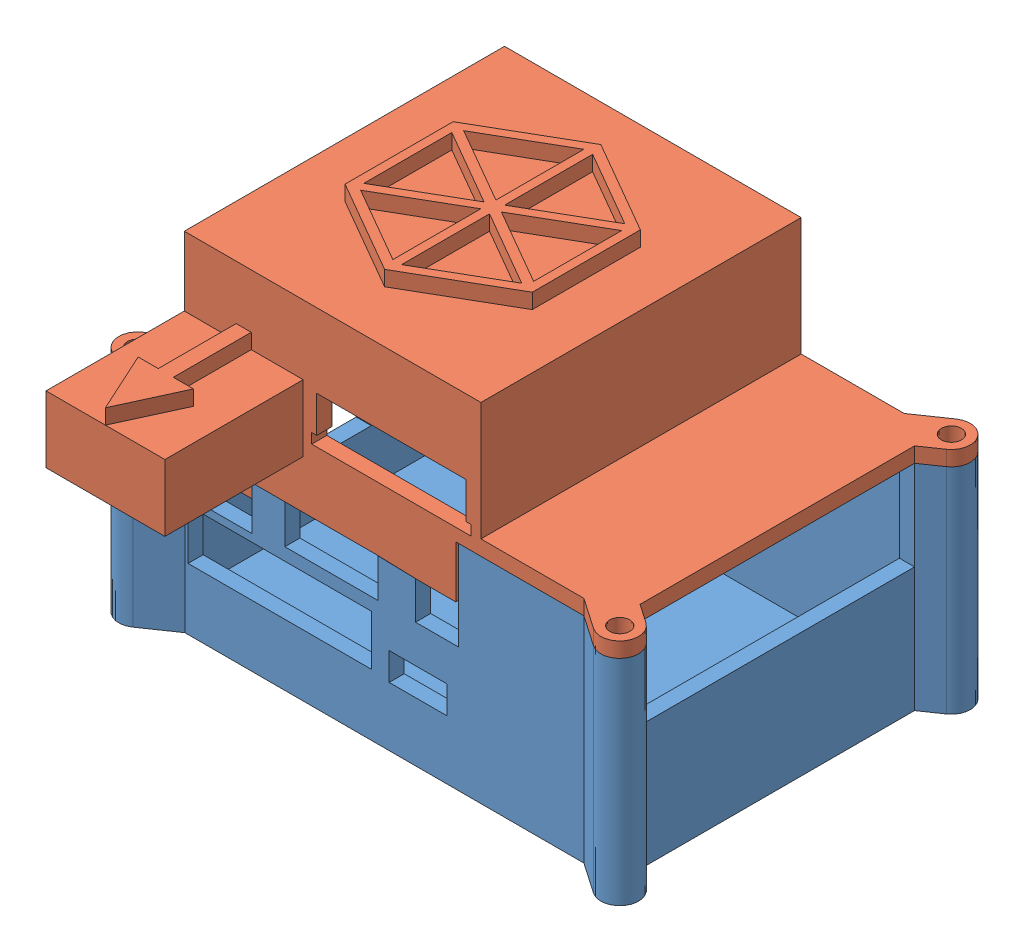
SolidWorks assembly Assem1.SLDASM, configuration Default (file format 11000). Lengths in mm.
Overall size (146.61 72.1 108.14).
2 component instances, 2 part files, 3 mates.
Components (placement in the parent):
- Base-2: Base.SLDPRT [Default] at (96.3843 26.103 102.6325) size (130.35 66.1 89.97)
- Top-2: Top.SLDPRT [Default] at (3.7843 68.703 38.9325) x (-1 0 0) z (0 0 -1) size (146.61 42.35 108.14)
Mates (geometry in assembly coordinates):
- Concentric7: concentric: circle of Base-2; circle of Top-2
- Coincident7: coincident: cylinder of Base-2 through (98.032 68.703 103.766) axis (0 -1 0) radius 2; circle of Top-2
- Coincident8: coincident: plane of Base-2 through (2.1365 68.703 103.766) normal (0 1 0); plane of Top-2 through (98.032 68.703 103.766) normal (0 -1 0)
